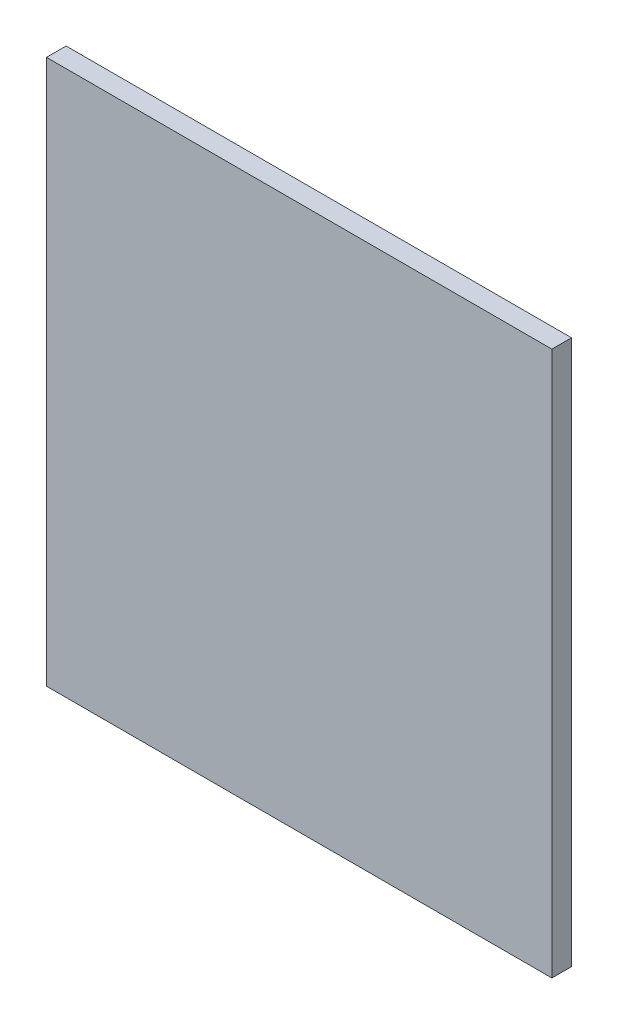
ISO-10303-21;
HEADER;
FILE_DESCRIPTION(('STEP AP214'),'2;1');
FILE_NAME('part.step','',(''),(''),'','','');
FILE_SCHEMA(('AUTOMOTIVE_DESIGN { 1 0 10303 214 1 1 1 1 }'));
ENDSEC;
DATA;
#1=APPLICATION_CONTEXT('core data for automotive mechanical design processes');
#2=APPLICATION_PROTOCOL_DEFINITION('international standard','automotive_design',2000,#1);
#3=PRODUCT_CONTEXT('',#1,'mechanical');
#4=PRODUCT('Part','Part','',(#3));
#5=PRODUCT_RELATED_PRODUCT_CATEGORY('part','',(#4));
#6=PRODUCT_DEFINITION_FORMATION('','',#4);
#7=PRODUCT_DEFINITION_CONTEXT('part definition',#1,'design');
#8=PRODUCT_DEFINITION('design','',#6,#7);
#9=PRODUCT_DEFINITION_SHAPE('','',#8);
#10=(LENGTH_UNIT() NAMED_UNIT(*) SI_UNIT(.MILLI.,.METRE.));
#11=(NAMED_UNIT(*) PLANE_ANGLE_UNIT() SI_UNIT($,.RADIAN.));
#12=(NAMED_UNIT(*) SI_UNIT($,.STERADIAN.) SOLID_ANGLE_UNIT());
#13=UNCERTAINTY_MEASURE_WITH_UNIT(LENGTH_MEASURE(1.E-05),#10,'distance_accuracy_value','');
#14=(GEOMETRIC_REPRESENTATION_CONTEXT(3) GLOBAL_UNCERTAINTY_ASSIGNED_CONTEXT((#13)) GLOBAL_UNIT_ASSIGNED_CONTEXT((#10,
#11,#12)) REPRESENTATION_CONTEXT('',''));
#15=CARTESIAN_POINT('',(0.,0.,0.));
#16=DIRECTION('',(0.,0.,1.));
#17=DIRECTION('',(1.,0.,0.));
#18=AXIS2_PLACEMENT_3D('',#15,#16,#17);
#19=CARTESIAN_POINT('',(-50.,50.,0.));
#20=DIRECTION('',(1.,0.,0.));
#21=DIRECTION('',(0.,0.,-1.));
#22=AXIS2_PLACEMENT_3D('',#19,#20,#21);
#23=PLANE('',#22);
#24=DIRECTION('',(0.,-1.,0.));
#25=VECTOR('',#24,1.);
#26=CARTESIAN_POINT('',(-50.,50.,-4.));
#27=LINE('',#26,#25);
#28=CARTESIAN_POINT('',(-50.,50.,-4.));
#29=VERTEX_POINT('',#28);
#30=CARTESIAN_POINT('',(-50.,-61.,-4.));
#31=VERTEX_POINT('',#30);
#32=EDGE_CURVE('E106',#29,#31,#27,.T.);
#33=ORIENTED_EDGE('',*,*,#32,.T.);
#34=DIRECTION('',(0.,0.,-1.));
#35=VECTOR('',#34,1.);
#36=CARTESIAN_POINT('',(-50.,-61.,0.));
#37=LINE('',#36,#35);
#38=CARTESIAN_POINT('',(-50.,-61.,0.));
#39=VERTEX_POINT('',#38);
#40=EDGE_CURVE('E11',#39,#31,#37,.T.);
#41=ORIENTED_EDGE('',*,*,#40,.F.);
#42=DIRECTION('',(0.,-1.,0.));
#43=VECTOR('',#42,1.);
#44=CARTESIAN_POINT('',(-50.,50.,0.));
#45=LINE('',#44,#43);
#46=CARTESIAN_POINT('',(-50.,50.,0.));
#47=VERTEX_POINT('',#46);
#48=EDGE_CURVE('E94',#47,#39,#45,.T.);
#49=ORIENTED_EDGE('',*,*,#48,.F.);
#50=DIRECTION('',(0.,0.,-1.));
#51=VECTOR('',#50,1.);
#52=CARTESIAN_POINT('',(-50.,50.,0.));
#53=LINE('',#52,#51);
#54=EDGE_CURVE('E102',#47,#29,#53,.T.);
#55=ORIENTED_EDGE('',*,*,#54,.T.);
#56=EDGE_LOOP('',(#33,#41,#49,#55));
#57=FACE_BOUND('',#56,.T.);
#58=ADVANCED_FACE('F43',(#57),#23,.F.);
#59=CARTESIAN_POINT('',(-50.,-61.,0.));
#60=DIRECTION('',(0.,1.,0.));
#61=DIRECTION('',(0.,0.,1.));
#62=AXIS2_PLACEMENT_3D('',#59,#60,#61);
#63=PLANE('',#62);
#64=DIRECTION('',(1.,0.,0.));
#65=VECTOR('',#64,1.);
#66=CARTESIAN_POINT('',(-50.,-61.,-4.));
#67=LINE('',#66,#65);
#68=CARTESIAN_POINT('',(53.,-61.,-4.));
#69=VERTEX_POINT('',#68);
#70=EDGE_CURVE('E98',#31,#69,#67,.T.);
#71=ORIENTED_EDGE('',*,*,#70,.T.);
#72=DIRECTION('',(0.,0.,-1.));
#73=VECTOR('',#72,1.);
#74=CARTESIAN_POINT('',(53.,-61.,0.));
#75=LINE('',#74,#73);
#76=CARTESIAN_POINT('',(53.,-61.,0.));
#77=VERTEX_POINT('',#76);
#78=EDGE_CURVE('E51',#77,#69,#75,.T.);
#79=ORIENTED_EDGE('',*,*,#78,.F.);
#80=DIRECTION('',(1.,0.,0.));
#81=VECTOR('',#80,1.);
#82=CARTESIAN_POINT('',(-50.,-61.,0.));
#83=LINE('',#82,#81);
#84=EDGE_CURVE('E89',#39,#77,#83,.T.);
#85=ORIENTED_EDGE('',*,*,#84,.F.);
#86=ORIENTED_EDGE('',*,*,#40,.T.);
#87=EDGE_LOOP('',(#71,#79,#85,#86));
#88=FACE_BOUND('',#87,.T.);
#89=ADVANCED_FACE('F97',(#88),#63,.F.);
#90=CARTESIAN_POINT('',(53.,-61.,0.));
#91=DIRECTION('',(-1.,0.,0.));
#92=DIRECTION('',(0.,0.,1.));
#93=AXIS2_PLACEMENT_3D('',#90,#91,#92);
#94=PLANE('',#93);
#95=DIRECTION('',(0.,1.,0.));
#96=VECTOR('',#95,1.);
#97=CARTESIAN_POINT('',(53.,-61.,-4.));
#98=LINE('',#97,#96);
#99=CARTESIAN_POINT('',(53.,50.,-4.));
#100=VERTEX_POINT('',#99);
#101=EDGE_CURVE('E76',#69,#100,#98,.T.);
#102=ORIENTED_EDGE('',*,*,#101,.T.);
#103=DIRECTION('',(0.,0.,-1.));
#104=VECTOR('',#103,1.);
#105=CARTESIAN_POINT('',(53.,50.,0.));
#106=LINE('',#105,#104);
#107=CARTESIAN_POINT('',(53.,50.,0.));
#108=VERTEX_POINT('',#107);
#109=EDGE_CURVE('E99',#108,#100,#106,.T.);
#110=ORIENTED_EDGE('',*,*,#109,.F.);
#111=DIRECTION('',(0.,1.,0.));
#112=VECTOR('',#111,1.);
#113=CARTESIAN_POINT('',(53.,-61.,0.));
#114=LINE('',#113,#112);
#115=EDGE_CURVE('E92',#77,#108,#114,.T.);
#116=ORIENTED_EDGE('',*,*,#115,.F.);
#117=ORIENTED_EDGE('',*,*,#78,.T.);
#118=EDGE_LOOP('',(#102,#110,#116,#117));
#119=FACE_BOUND('',#118,.T.);
#120=ADVANCED_FACE('F100',(#119),#94,.F.);
#121=CARTESIAN_POINT('',(53.,50.,0.));
#122=DIRECTION('',(0.,-1.,0.));
#123=DIRECTION('',(0.,0.,-1.));
#124=AXIS2_PLACEMENT_3D('',#121,#122,#123);
#125=PLANE('',#124);
#126=DIRECTION('',(-1.,0.,0.));
#127=VECTOR('',#126,1.);
#128=CARTESIAN_POINT('',(53.,50.,-4.));
#129=LINE('',#128,#127);
#130=EDGE_CURVE('E82',#100,#29,#129,.T.);
#131=ORIENTED_EDGE('',*,*,#130,.T.);
#132=ORIENTED_EDGE('',*,*,#54,.F.);
#133=DIRECTION('',(-1.,0.,0.));
#134=VECTOR('',#133,1.);
#135=CARTESIAN_POINT('',(53.,50.,0.));
#136=LINE('',#135,#134);
#137=EDGE_CURVE('E59',#108,#47,#136,.T.);
#138=ORIENTED_EDGE('',*,*,#137,.F.);
#139=ORIENTED_EDGE('',*,*,#109,.T.);
#140=EDGE_LOOP('',(#131,#132,#138,#139));
#141=FACE_BOUND('',#140,.T.);
#142=ADVANCED_FACE('F113',(#141),#125,.F.);
#143=CARTESIAN_POINT('',(0.,0.,0.));
#144=DIRECTION('',(0.,0.,1.));
#145=DIRECTION('',(1.,0.,0.));
#146=AXIS2_PLACEMENT_3D('',#143,#144,#145);
#147=PLANE('',#146);
#148=ORIENTED_EDGE('',*,*,#48,.T.);
#149=ORIENTED_EDGE('',*,*,#84,.T.);
#150=ORIENTED_EDGE('',*,*,#115,.T.);
#151=ORIENTED_EDGE('',*,*,#137,.T.);
#152=EDGE_LOOP('',(#148,#149,#150,#151));
#153=FACE_BOUND('',#152,.T.);
#154=ADVANCED_FACE('F90',(#153),#147,.T.);
#155=CARTESIAN_POINT('',(0.,0.,-4.));
#156=DIRECTION('',(0.,0.,1.));
#157=DIRECTION('',(1.,0.,0.));
#158=AXIS2_PLACEMENT_3D('',#155,#156,#157);
#159=PLANE('',#158);
#160=ORIENTED_EDGE('',*,*,#32,.F.);
#161=ORIENTED_EDGE('',*,*,#130,.F.);
#162=ORIENTED_EDGE('',*,*,#101,.F.);
#163=ORIENTED_EDGE('',*,*,#70,.F.);
#164=EDGE_LOOP('',(#160,#161,#162,#163));
#165=FACE_BOUND('',#164,.T.);
#166=ADVANCED_FACE('F116',(#165),#159,.F.);
#167=CLOSED_SHELL('',(#58,#89,#120,#142,#154,#166));
#168=MANIFOLD_SOLID_BREP('B2',#167);
#169=ADVANCED_BREP_SHAPE_REPRESENTATION('',(#18,#168),#14);
#170=SHAPE_DEFINITION_REPRESENTATION(#9,#169);
ENDSEC;
END-ISO-10303-21;
